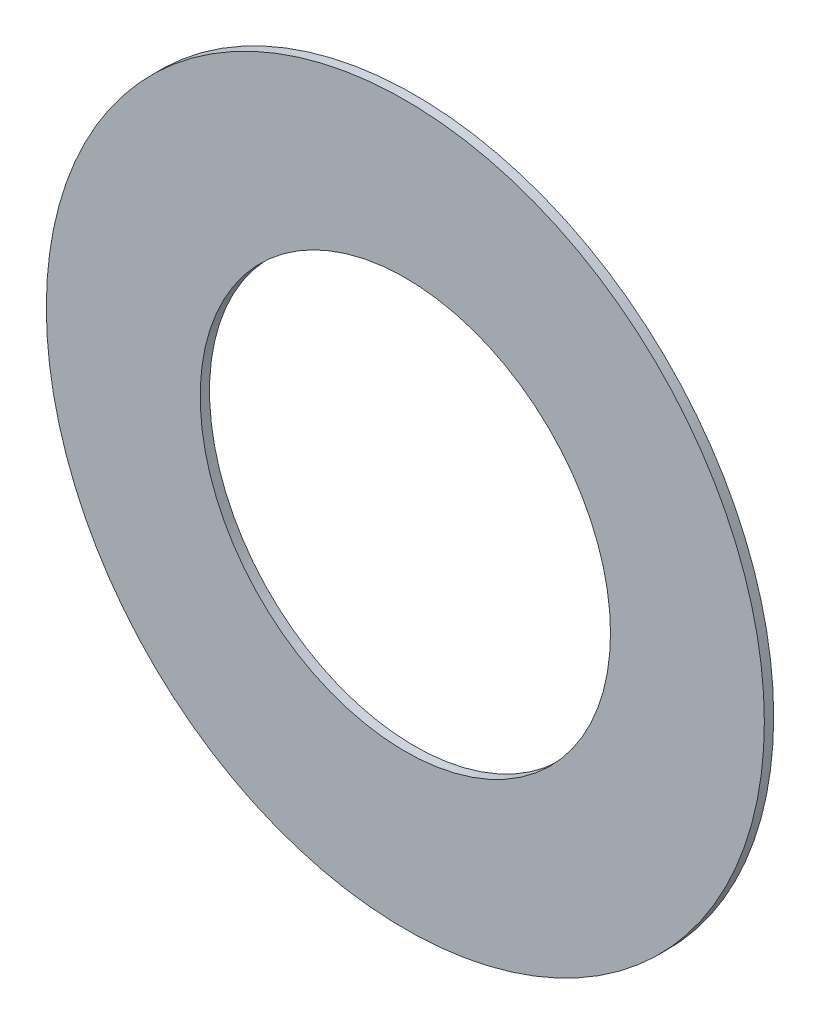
ISO-10303-21;
HEADER;
FILE_DESCRIPTION(('STEP AP214'),'2;1');
FILE_NAME('part.step','',(''),(''),'','','');
FILE_SCHEMA(('AUTOMOTIVE_DESIGN { 1 0 10303 214 1 1 1 1 }'));
ENDSEC;
DATA;
#1=APPLICATION_CONTEXT('core data for automotive mechanical design processes');
#2=APPLICATION_PROTOCOL_DEFINITION('international standard','automotive_design',2000,#1);
#3=PRODUCT_CONTEXT('',#1,'mechanical');
#4=PRODUCT('Part','Part','',(#3));
#5=PRODUCT_RELATED_PRODUCT_CATEGORY('part','',(#4));
#6=PRODUCT_DEFINITION_FORMATION('','',#4);
#7=PRODUCT_DEFINITION_CONTEXT('part definition',#1,'design');
#8=PRODUCT_DEFINITION('design','',#6,#7);
#9=PRODUCT_DEFINITION_SHAPE('','',#8);
#10=(LENGTH_UNIT() NAMED_UNIT(*) SI_UNIT(.MILLI.,.METRE.));
#11=(NAMED_UNIT(*) PLANE_ANGLE_UNIT() SI_UNIT($,.RADIAN.));
#12=(NAMED_UNIT(*) SI_UNIT($,.STERADIAN.) SOLID_ANGLE_UNIT());
#13=UNCERTAINTY_MEASURE_WITH_UNIT(LENGTH_MEASURE(1.E-05),#10,'distance_accuracy_value','');
#14=(GEOMETRIC_REPRESENTATION_CONTEXT(3) GLOBAL_UNCERTAINTY_ASSIGNED_CONTEXT((#13)) GLOBAL_UNIT_ASSIGNED_CONTEXT((#10,
#11,#12)) REPRESENTATION_CONTEXT('',''));
#15=CARTESIAN_POINT('',(0.,0.,0.));
#16=DIRECTION('',(0.,0.,1.));
#17=DIRECTION('',(1.,0.,0.));
#18=AXIS2_PLACEMENT_3D('',#15,#16,#17);
#19=CARTESIAN_POINT('',(0.,0.,5.));
#20=DIRECTION('',(0.,0.,1.));
#21=DIRECTION('',(1.,0.,0.));
#22=AXIS2_PLACEMENT_3D('',#19,#20,#21);
#23=PLANE('',#22);
#24=CARTESIAN_POINT('',(0.,0.,5.));
#25=DIRECTION('',(0.,0.,1.));
#26=DIRECTION('',(1.,0.,0.));
#27=AXIS2_PLACEMENT_3D('',#24,#25,#26);
#28=CIRCLE('',#27,192.5);
#29=CARTESIAN_POINT('',(192.5,0.,5.));
#30=VERTEX_POINT('',#29);
#31=EDGE_CURVE('E10',#30,#30,#28,.T.);
#32=ORIENTED_EDGE('',*,*,#31,.T.);
#33=EDGE_LOOP('',(#32));
#34=FACE_BOUND('',#33,.T.);
#35=CARTESIAN_POINT('',(0.,0.,5.));
#36=DIRECTION('',(0.,0.,1.));
#37=DIRECTION('',(1.,0.,0.));
#38=AXIS2_PLACEMENT_3D('',#35,#36,#37);
#39=CIRCLE('',#38,110.);
#40=CARTESIAN_POINT('',(110.,0.,5.));
#41=VERTEX_POINT('',#40);
#42=EDGE_CURVE('E40',#41,#41,#39,.T.);
#43=ORIENTED_EDGE('',*,*,#42,.F.);
#44=EDGE_LOOP('',(#43));
#45=FACE_BOUND('',#44,.T.);
#46=ADVANCED_FACE('F29',(#34,#45),#23,.T.);
#47=CARTESIAN_POINT('',(0.,0.,0.));
#48=DIRECTION('',(0.,0.,1.));
#49=DIRECTION('',(1.,0.,0.));
#50=AXIS2_PLACEMENT_3D('',#47,#48,#49);
#51=PLANE('',#50);
#52=CARTESIAN_POINT('',(0.,0.,0.));
#53=DIRECTION('',(0.,0.,1.));
#54=DIRECTION('',(1.,0.,0.));
#55=AXIS2_PLACEMENT_3D('',#52,#53,#54);
#56=CIRCLE('',#55,192.5);
#57=CARTESIAN_POINT('',(192.5,0.,0.));
#58=VERTEX_POINT('',#57);
#59=EDGE_CURVE('E36',#58,#58,#56,.T.);
#60=ORIENTED_EDGE('',*,*,#59,.F.);
#61=EDGE_LOOP('',(#60));
#62=FACE_BOUND('',#61,.T.);
#63=CARTESIAN_POINT('',(0.,0.,0.));
#64=DIRECTION('',(0.,0.,1.));
#65=DIRECTION('',(1.,0.,0.));
#66=AXIS2_PLACEMENT_3D('',#63,#64,#65);
#67=CIRCLE('',#66,110.);
#68=CARTESIAN_POINT('',(110.,0.,0.));
#69=VERTEX_POINT('',#68);
#70=EDGE_CURVE('E44',#69,#69,#67,.T.);
#71=ORIENTED_EDGE('',*,*,#70,.T.);
#72=EDGE_LOOP('',(#71));
#73=FACE_BOUND('',#72,.T.);
#74=ADVANCED_FACE('F50',(#62,#73),#51,.F.);
#75=CARTESIAN_POINT('',(0.,0.,5.));
#76=DIRECTION('',(0.,0.,-1.));
#77=DIRECTION('',(-1.,0.,0.));
#78=AXIS2_PLACEMENT_3D('',#75,#76,#77);
#79=CYLINDRICAL_SURFACE('',#78,192.5);
#80=ORIENTED_EDGE('',*,*,#31,.F.);
#81=EDGE_LOOP('',(#80));
#82=FACE_BOUND('',#81,.T.);
#83=ORIENTED_EDGE('',*,*,#59,.T.);
#84=EDGE_LOOP('',(#83));
#85=FACE_BOUND('',#84,.T.);
#86=ADVANCED_FACE('F31',(#82,#85),#79,.T.);
#87=CARTESIAN_POINT('',(0.,0.,5.));
#88=DIRECTION('',(0.,0.,-1.));
#89=DIRECTION('',(-1.,0.,0.));
#90=AXIS2_PLACEMENT_3D('',#87,#88,#89);
#91=CYLINDRICAL_SURFACE('',#90,110.);
#92=ORIENTED_EDGE('',*,*,#42,.T.);
#93=EDGE_LOOP('',(#92));
#94=FACE_BOUND('',#93,.T.);
#95=ORIENTED_EDGE('',*,*,#70,.F.);
#96=EDGE_LOOP('',(#95));
#97=FACE_BOUND('',#96,.T.);
#98=ADVANCED_FACE('F52',(#94,#97),#91,.F.);
#99=CLOSED_SHELL('',(#46,#74,#86,#98));
#100=MANIFOLD_SOLID_BREP('B2',#99);
#101=ADVANCED_BREP_SHAPE_REPRESENTATION('',(#18,#100),#14);
#102=SHAPE_DEFINITION_REPRESENTATION(#9,#101);
ENDSEC;
END-ISO-10303-21;
